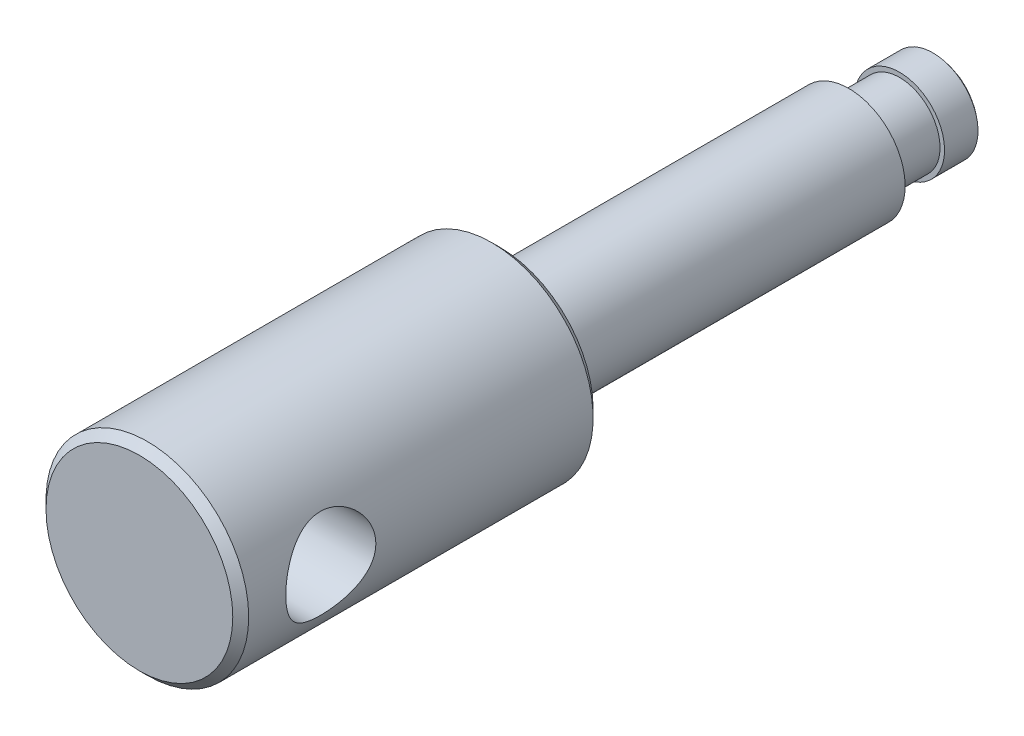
ISO-10303-21;
HEADER;
FILE_DESCRIPTION(('STEP AP214'),'2;1');
FILE_NAME('part.step','',(''),(''),'','','');
FILE_SCHEMA(('AUTOMOTIVE_DESIGN { 1 0 10303 214 1 1 1 1 }'));
ENDSEC;
DATA;
#1=APPLICATION_CONTEXT('core data for automotive mechanical design processes');
#2=APPLICATION_PROTOCOL_DEFINITION('international standard','automotive_design',2000,#1);
#3=PRODUCT_CONTEXT('',#1,'mechanical');
#4=PRODUCT('Part','Part','',(#3));
#5=PRODUCT_RELATED_PRODUCT_CATEGORY('part','',(#4));
#6=PRODUCT_DEFINITION_FORMATION('','',#4);
#7=PRODUCT_DEFINITION_CONTEXT('part definition',#1,'design');
#8=PRODUCT_DEFINITION('design','',#6,#7);
#9=PRODUCT_DEFINITION_SHAPE('','',#8);
#10=(LENGTH_UNIT() NAMED_UNIT(*) SI_UNIT(.MILLI.,.METRE.));
#11=(NAMED_UNIT(*) PLANE_ANGLE_UNIT() SI_UNIT($,.RADIAN.));
#12=(NAMED_UNIT(*) SI_UNIT($,.STERADIAN.) SOLID_ANGLE_UNIT());
#13=UNCERTAINTY_MEASURE_WITH_UNIT(LENGTH_MEASURE(1.E-05),#10,'distance_accuracy_value','');
#14=(GEOMETRIC_REPRESENTATION_CONTEXT(3) GLOBAL_UNCERTAINTY_ASSIGNED_CONTEXT((#13)) GLOBAL_UNIT_ASSIGNED_CONTEXT((#10,
#11,#12)) REPRESENTATION_CONTEXT('',''));
#15=CARTESIAN_POINT('',(0.,0.,0.));
#16=DIRECTION('',(0.,0.,1.));
#17=DIRECTION('',(1.,0.,0.));
#18=AXIS2_PLACEMENT_3D('',#15,#16,#17);
#19=CARTESIAN_POINT('',(0.,0.,6.));
#20=DIRECTION('',(-1.,0.,0.));
#21=DIRECTION('',(0.,1.,0.));
#22=AXIS2_PLACEMENT_3D('',#19,#20,#21);
#23=SPHERICAL_SURFACE('',#22,6.);
#24=CARTESIAN_POINT('',(0.,0.,1.52786404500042));
#25=DIRECTION('',(0.,0.,1.));
#26=DIRECTION('',(0.,-1.,0.));
#27=AXIS2_PLACEMENT_3D('',#24,#25,#26);
#28=CIRCLE('',#27,4.);
#29=CARTESIAN_POINT('',(0.,-4.,1.52786404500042));
#30=VERTEX_POINT('',#29);
#31=EDGE_CURVE('E112',#30,#30,#28,.T.);
#32=ORIENTED_EDGE('',*,*,#31,.F.);
#33=EDGE_LOOP('',(#32));
#34=FACE_BOUND('',#33,.T.);
#35=ADVANCED_FACE('F12',(#34),#23,.T.);
#36=CARTESIAN_POINT('',(0.,0.,0.));
#37=DIRECTION('',(0.,0.,1.));
#38=DIRECTION('',(0.,-1.,0.));
#39=AXIS2_PLACEMENT_3D('',#36,#37,#38);
#40=CYLINDRICAL_SURFACE('',#39,4.);
#41=CARTESIAN_POINT('',(0.,0.,4.5));
#42=DIRECTION('',(0.,0.,1.));
#43=DIRECTION('',(0.,-1.,0.));
#44=AXIS2_PLACEMENT_3D('',#41,#42,#43);
#45=CIRCLE('',#44,4.);
#46=CARTESIAN_POINT('',(0.,-4.,4.5));
#47=VERTEX_POINT('',#46);
#48=EDGE_CURVE('E113',#47,#47,#45,.F.);
#49=ORIENTED_EDGE('',*,*,#48,.T.);
#50=EDGE_LOOP('',(#49));
#51=FACE_BOUND('',#50,.T.);
#52=ORIENTED_EDGE('',*,*,#31,.T.);
#53=EDGE_LOOP('',(#52));
#54=FACE_BOUND('',#53,.T.);
#55=ADVANCED_FACE('F75',(#51,#54),#40,.T.);
#56=CARTESIAN_POINT('',(3.6,0.,4.5));
#57=DIRECTION('',(0.,0.,-1.));
#58=DIRECTION('',(0.,1.,0.));
#59=AXIS2_PLACEMENT_3D('',#56,#57,#58);
#60=PLANE('',#59);
#61=CARTESIAN_POINT('',(0.,0.,4.5));
#62=DIRECTION('',(0.,0.,1.));
#63=DIRECTION('',(0.,-1.,0.));
#64=AXIS2_PLACEMENT_3D('',#61,#62,#63);
#65=CIRCLE('',#64,3.6);
#66=CARTESIAN_POINT('',(0.,-3.6,4.5));
#67=VERTEX_POINT('',#66);
#68=EDGE_CURVE('E94',#67,#67,#65,.T.);
#69=ORIENTED_EDGE('',*,*,#68,.F.);
#70=EDGE_LOOP('',(#69));
#71=FACE_BOUND('',#70,.T.);
#72=ORIENTED_EDGE('',*,*,#48,.F.);
#73=EDGE_LOOP('',(#72));
#74=FACE_BOUND('',#73,.T.);
#75=ADVANCED_FACE('F71',(#71,#74),#60,.F.);
#76=CARTESIAN_POINT('',(0.,0.,0.));
#77=DIRECTION('',(0.,0.,1.));
#78=DIRECTION('',(0.,-1.,0.));
#79=AXIS2_PLACEMENT_3D('',#76,#77,#78);
#80=CYLINDRICAL_SURFACE('',#79,3.6);
#81=CARTESIAN_POINT('',(0.,0.,8.19170962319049));
#82=DIRECTION('',(0.,0.,1.));
#83=DIRECTION('',(0.,-1.,0.));
#84=AXIS2_PLACEMENT_3D('',#81,#82,#83);
#85=CIRCLE('',#84,3.60000000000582);
#86=CARTESIAN_POINT('',(0.,-3.60000000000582,8.19170962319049));
#87=VERTEX_POINT('',#86);
#88=EDGE_CURVE('E90',#87,#87,#85,.T.);
#89=ORIENTED_EDGE('',*,*,#88,.F.);
#90=EDGE_LOOP('',(#89));
#91=FACE_BOUND('',#90,.T.);
#92=ORIENTED_EDGE('',*,*,#68,.T.);
#93=EDGE_LOOP('',(#92));
#94=FACE_BOUND('',#93,.T.);
#95=ADVANCED_FACE('F67',(#91,#94),#80,.T.);
#96=CARTESIAN_POINT('',(0.,0.,9.00000000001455));
#97=DIRECTION('',(0.,0.,1.));
#98=DIRECTION('',(0.,-1.,0.));
#99=AXIS2_PLACEMENT_3D('',#96,#97,#98);
#100=CONICAL_SURFACE('',#99,4.99999999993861,1.047197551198);
#101=CARTESIAN_POINT('',(0.,0.,9.));
#102=DIRECTION('',(0.,0.,1.));
#103=DIRECTION('',(0.,-1.,0.));
#104=AXIS2_PLACEMENT_3D('',#101,#102,#103);
#105=CIRCLE('',#104,5.);
#106=CARTESIAN_POINT('',(0.,-5.,9.));
#107=VERTEX_POINT('',#106);
#108=EDGE_CURVE('E97',#107,#107,#105,.T.);
#109=ORIENTED_EDGE('',*,*,#108,.F.);
#110=EDGE_LOOP('',(#109));
#111=FACE_BOUND('',#110,.T.);
#112=ORIENTED_EDGE('',*,*,#88,.T.);
#113=EDGE_LOOP('',(#112));
#114=FACE_BOUND('',#113,.T.);
#115=ADVANCED_FACE('F63',(#111,#114),#100,.T.);
#116=CARTESIAN_POINT('',(0.,0.,0.));
#117=DIRECTION('',(0.,0.,1.));
#118=DIRECTION('',(0.,-1.,0.));
#119=AXIS2_PLACEMENT_3D('',#116,#117,#118);
#120=CYLINDRICAL_SURFACE('',#119,5.);
#121=CARTESIAN_POINT('',(0.,0.,40.));
#122=DIRECTION('',(0.,0.,1.));
#123=DIRECTION('',(0.,-1.,0.));
#124=AXIS2_PLACEMENT_3D('',#121,#122,#123);
#125=CIRCLE('',#124,5.);
#126=CARTESIAN_POINT('',(0.,-5.,40.));
#127=VERTEX_POINT('',#126);
#128=EDGE_CURVE('E93',#127,#127,#125,.F.);
#129=ORIENTED_EDGE('',*,*,#128,.T.);
#130=EDGE_LOOP('',(#129));
#131=FACE_BOUND('',#130,.T.);
#132=ORIENTED_EDGE('',*,*,#108,.T.);
#133=EDGE_LOOP('',(#132));
#134=FACE_BOUND('',#133,.T.);
#135=ADVANCED_FACE('F59',(#131,#134),#120,.T.);
#136=CARTESIAN_POINT('',(8.29289321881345,0.,40.));
#137=DIRECTION('',(0.,0.,1.));
#138=DIRECTION('',(0.,-1.,0.));
#139=AXIS2_PLACEMENT_3D('',#136,#137,#138);
#140=PLANE('',#139);
#141=CARTESIAN_POINT('',(0.,0.,40.));
#142=DIRECTION('',(0.,0.,1.));
#143=DIRECTION('',(0.,-1.,0.));
#144=AXIS2_PLACEMENT_3D('',#141,#142,#143);
#145=CIRCLE('',#144,8.29289321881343);
#146=CARTESIAN_POINT('',(0.,-8.29289321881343,40.));
#147=VERTEX_POINT('',#146);
#148=EDGE_CURVE('E100',#147,#147,#145,.T.);
#149=ORIENTED_EDGE('',*,*,#148,.F.);
#150=EDGE_LOOP('',(#149));
#151=FACE_BOUND('',#150,.T.);
#152=ORIENTED_EDGE('',*,*,#128,.F.);
#153=EDGE_LOOP('',(#152));
#154=FACE_BOUND('',#153,.T.);
#155=ADVANCED_FACE('F55',(#151,#154),#140,.F.);
#156=CARTESIAN_POINT('',(0.,0.,72.));
#157=DIRECTION('',(0.,0.,-1.));
#158=DIRECTION('',(0.,1.,0.));
#159=AXIS2_PLACEMENT_3D('',#156,#157,#158);
#160=PLANE('',#159);
#161=CARTESIAN_POINT('',(0.,0.,72.));
#162=DIRECTION('',(0.,0.,-1.));
#163=DIRECTION('',(1.,0.,0.));
#164=AXIS2_PLACEMENT_3D('',#161,#162,#163);
#165=CIRCLE('',#164,8.29289321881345);
#166=CARTESIAN_POINT('',(8.29289321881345,0.,72.));
#167=VERTEX_POINT('',#166);
#168=EDGE_CURVE('E86',#167,#167,#165,.T.);
#169=ORIENTED_EDGE('',*,*,#168,.F.);
#170=EDGE_LOOP('',(#169));
#171=FACE_BOUND('',#170,.T.);
#172=ADVANCED_FACE('F51',(#171),#160,.F.);
#173=CARTESIAN_POINT('',(0.,0.,40.7071067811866));
#174=DIRECTION('',(0.,0.,1.));
#175=DIRECTION('',(0.,-1.,0.));
#176=AXIS2_PLACEMENT_3D('',#173,#174,#175);
#177=CONICAL_SURFACE('',#176,9.,0.785398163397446);
#178=CARTESIAN_POINT('',(0.,0.,40.7071067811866));
#179=DIRECTION('',(0.,0.,1.));
#180=DIRECTION('',(0.,-1.,0.));
#181=AXIS2_PLACEMENT_3D('',#178,#179,#180);
#182=CIRCLE('',#181,9.);
#183=CARTESIAN_POINT('',(0.,-9.,40.7071067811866));
#184=VERTEX_POINT('',#183);
#185=EDGE_CURVE('E27',#184,#184,#182,.T.);
#186=ORIENTED_EDGE('',*,*,#185,.F.);
#187=EDGE_LOOP('',(#186));
#188=FACE_BOUND('',#187,.T.);
#189=ORIENTED_EDGE('',*,*,#148,.T.);
#190=EDGE_LOOP('',(#189));
#191=FACE_BOUND('',#190,.T.);
#192=ADVANCED_FACE('F47',(#188,#191),#177,.T.);
#193=CARTESIAN_POINT('',(0.,0.,71.2928932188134));
#194=DIRECTION('',(0.,0.,-1.));
#195=DIRECTION('',(1.,0.,0.));
#196=AXIS2_PLACEMENT_3D('',#193,#194,#195);
#197=CONICAL_SURFACE('',#196,9.,0.785398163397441);
#198=ORIENTED_EDGE('',*,*,#168,.T.);
#199=EDGE_LOOP('',(#198));
#200=FACE_BOUND('',#199,.T.);
#201=CARTESIAN_POINT('',(0.,0.,71.2928932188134));
#202=DIRECTION('',(0.,0.,1.));
#203=DIRECTION('',(0.,-1.,0.));
#204=AXIS2_PLACEMENT_3D('',#201,#202,#203);
#205=CIRCLE('',#204,9.);
#206=CARTESIAN_POINT('',(0.,-9.,71.2928932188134));
#207=VERTEX_POINT('',#206);
#208=EDGE_CURVE('E31',#207,#207,#205,.F.);
#209=ORIENTED_EDGE('',*,*,#208,.F.);
#210=EDGE_LOOP('',(#209));
#211=FACE_BOUND('',#210,.T.);
#212=ADVANCED_FACE('F42',(#200,#211),#197,.T.);
#213=CARTESIAN_POINT('',(0.,0.,0.));
#214=DIRECTION('',(0.,0.,1.));
#215=DIRECTION('',(0.,-1.,0.));
#216=AXIS2_PLACEMENT_3D('',#213,#214,#215);
#217=CYLINDRICAL_SURFACE('',#216,9.);
#218=CARTESIAN_POINT('',(-8.06225774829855,4.,64.));
#219=CARTESIAN_POINT('',(-8.06225871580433,3.99999911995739,63.8940426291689));
#220=CARTESIAN_POINT('',(-8.06435392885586,3.99578365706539,63.7880560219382));
#221=CARTESIAN_POINT('',(-8.07266315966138,3.9789689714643,63.5768687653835));
#222=CARTESIAN_POINT('',(-8.07887962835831,3.96636475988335,63.4716686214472));
#223=CARTESIAN_POINT('',(-8.09523141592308,3.93288406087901,63.2626821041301));
#224=CARTESIAN_POINT('',(-8.10537442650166,3.91199133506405,63.1588989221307));
#225=CARTESIAN_POINT('',(-8.12922894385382,3.8621744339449,62.9536831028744));
#226=CARTESIAN_POINT('',(-8.1429419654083,3.83324684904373,62.8522514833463));
#227=CARTESIAN_POINT('',(-8.18864631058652,3.73514516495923,62.5534876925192));
#228=CARTESIAN_POINT('',(-8.2253027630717,3.6544602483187,62.3605118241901));
#229=CARTESIAN_POINT('',(-8.30683459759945,3.46512080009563,61.9909863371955));
#230=CARTESIAN_POINT('',(-8.35170881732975,3.35647022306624,61.8144344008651));
#231=CARTESIAN_POINT('',(-8.44818605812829,3.1060059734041,61.469998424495));
#232=CARTESIAN_POINT('',(-8.50003637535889,2.96250577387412,61.3034071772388));
#233=CARTESIAN_POINT('',(-8.60260345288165,2.64995455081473,60.9956903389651));
#234=CARTESIAN_POINT('',(-8.65331973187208,2.48089290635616,60.8545753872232));
#235=CARTESIAN_POINT('',(-8.75098098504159,2.11153557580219,60.5948734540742));
#236=CARTESIAN_POINT('',(-8.79760568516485,1.9100929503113,60.477786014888));
#237=CARTESIAN_POINT('',(-8.87874924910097,1.48791769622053,60.2797334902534));
#238=CARTESIAN_POINT('',(-8.91327418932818,1.26719481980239,60.1987502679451));
#239=CARTESIAN_POINT('',(-8.96456719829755,0.82635824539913,60.0800307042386));
#240=CARTESIAN_POINT('',(-8.98225241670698,0.606957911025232,60.0400501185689));
#241=CARTESIAN_POINT('',(-9.00123386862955,0.163899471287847,59.9971753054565));
#242=CARTESIAN_POINT('',(-9.00253773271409,-0.0597566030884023,59.9942638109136));
#243=CARTESIAN_POINT('',(-8.9891172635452,-0.488489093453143,60.0245297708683));
#244=CARTESIAN_POINT('',(-8.97549378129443,-0.693781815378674,60.0552284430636));
#245=CARTESIAN_POINT('',(-8.93530946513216,-1.09594639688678,60.1475366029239));
#246=CARTESIAN_POINT('',(-8.90874767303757,-1.29281763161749,60.2091483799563));
#247=CARTESIAN_POINT('',(-8.84470124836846,-1.67619924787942,60.3621943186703));
#248=CARTESIAN_POINT('',(-8.80705628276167,-1.86250594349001,60.4540687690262));
#249=CARTESIAN_POINT('',(-8.72443358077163,-2.21755082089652,60.6645696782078));
#250=CARTESIAN_POINT('',(-8.67945317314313,-2.38628256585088,60.7832058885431));
#251=CARTESIAN_POINT('',(-8.58241773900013,-2.7154801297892,61.054628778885));
#252=CARTESIAN_POINT('',(-8.53008453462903,-2.8742540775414,61.209366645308));
#253=CARTESIAN_POINT('',(-8.42674548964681,-3.16444740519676,61.5433403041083));
#254=CARTESIAN_POINT('',(-8.37574032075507,-3.29585316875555,61.7225882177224));
#255=CARTESIAN_POINT('',(-8.30349353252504,-3.4722141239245,62.0107379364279));
#256=CARTESIAN_POINT('',(-8.27968910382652,-3.52844732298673,62.1122551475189));
#257=CARTESIAN_POINT('',(-8.23475847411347,-3.63207089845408,62.3202557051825));
#258=CARTESIAN_POINT('',(-8.2136310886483,-3.67946519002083,62.4267368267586));
#259=CARTESIAN_POINT('',(-8.17480574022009,-3.76493796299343,62.6439523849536));
#260=CARTESIAN_POINT('',(-8.15710705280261,-3.80301841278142,62.754685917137));
#261=CARTESIAN_POINT('',(-8.12581877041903,-3.86942100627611,62.9795529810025));
#262=CARTESIAN_POINT('',(-8.11222690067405,-3.89774855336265,63.0936845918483));
#263=CARTESIAN_POINT('',(-8.09048889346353,-3.94265987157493,63.3163267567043));
#264=CARTESIAN_POINT('',(-8.08202710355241,-3.95992921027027,63.4246684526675));
#265=CARTESIAN_POINT('',(-8.06944257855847,-3.98551143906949,63.6426081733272));
#266=CARTESIAN_POINT('',(-8.06531779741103,-3.99382855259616,63.7522055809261));
#267=CARTESIAN_POINT('',(-8.06156002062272,-4.00140826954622,63.9717723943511));
#268=CARTESIAN_POINT('',(-8.06192629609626,-4.00067234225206,64.0817417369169));
#269=CARTESIAN_POINT('',(-8.06713428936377,-3.99016019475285,64.3011360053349));
#270=CARTESIAN_POINT('',(-8.07197583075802,-3.9803843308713,64.4105609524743));
#271=CARTESIAN_POINT('',(-8.08540695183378,-3.95302498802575,64.6195308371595));
#272=CARTESIAN_POINT('',(-8.09367676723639,-3.93610575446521,64.7191839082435));
#273=CARTESIAN_POINT('',(-8.11360050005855,-3.89486887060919,64.9166144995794));
#274=CARTESIAN_POINT('',(-8.12525556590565,-3.87054870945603,65.0143913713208));
#275=CARTESIAN_POINT('',(-8.16479240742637,-3.78682316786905,65.3039409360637));
#276=CARTESIAN_POINT('',(-8.19725658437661,-3.71663214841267,65.4920869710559));
#277=CARTESIAN_POINT('',(-8.27248834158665,-3.54611617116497,65.8623985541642));
#278=CARTESIAN_POINT('',(-8.31565196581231,-3.44458335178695,66.043919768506));
#279=CARTESIAN_POINT('',(-8.40692978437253,-3.21539109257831,66.3883189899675));
#280=CARTESIAN_POINT('',(-8.45504630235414,-3.08771936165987,66.5511881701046));
#281=CARTESIAN_POINT('',(-8.55631670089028,-2.79562298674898,66.8697587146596));
#282=CARTESIAN_POINT('',(-8.6095148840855,-2.62885906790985,67.0233092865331));
#283=CARTESIAN_POINT('',(-8.71080374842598,-2.27079015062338,67.3007272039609));
#284=CARTESIAN_POINT('',(-8.75889370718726,-2.07948168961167,67.4245903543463));
#285=CARTESIAN_POINT('',(-8.84519710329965,-1.67498083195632,67.6396869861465));
#286=CARTESIAN_POINT('',(-8.88332261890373,-1.46161537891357,67.730632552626));
#287=CARTESIAN_POINT('',(-8.94472578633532,-1.02045840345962,67.8745834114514));
#288=CARTESIAN_POINT('',(-8.96801362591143,-0.792676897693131,67.9276147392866));
#289=CARTESIAN_POINT('',(-8.99580137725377,-0.348228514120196,67.9906336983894));
#290=CARTESIAN_POINT('',(-9.00161841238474,-0.132069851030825,68.00364083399));
#291=CARTESIAN_POINT('',(-8.99760436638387,0.299340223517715,67.9946102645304));
#292=CARTESIAN_POINT('',(-8.98777674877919,0.514591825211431,67.9725803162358));
#293=CARTESIAN_POINT('',(-8.954312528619,0.928153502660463,67.8962552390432));
#294=CARTESIAN_POINT('',(-8.93130800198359,1.12679150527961,67.8434351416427));
#295=CARTESIAN_POINT('',(-8.87418367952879,1.51223596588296,67.7087522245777));
#296=CARTESIAN_POINT('',(-8.84006193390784,1.69904034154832,67.6268843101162));
#297=CARTESIAN_POINT('',(-8.76198674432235,2.06499399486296,67.4323035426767));
#298=CARTESIAN_POINT('',(-8.71765436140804,2.24339999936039,67.3183489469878));
#299=CARTESIAN_POINT('',(-8.62423537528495,2.57934407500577,67.0645296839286));
#300=CARTESIAN_POINT('',(-8.5751467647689,2.73687326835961,66.9246540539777));
#301=CARTESIAN_POINT('',(-8.47281938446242,3.03954409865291,66.6100798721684));
#302=CARTESIAN_POINT('',(-8.41955831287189,3.18273227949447,66.4335061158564));
#303=CARTESIAN_POINT('',(-8.31863267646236,3.43791440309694,66.057266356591));
#304=CARTESIAN_POINT('',(-8.27097161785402,3.5498888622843,65.8575860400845));
#305=CARTESIAN_POINT('',(-8.20816019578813,3.69171847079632,65.5441803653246));
#306=CARTESIAN_POINT('',(-8.18863116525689,3.73471557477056,65.4371069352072));
#307=CARTESIAN_POINT('',(-8.15320381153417,3.81143772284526,65.219125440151));
#308=CARTESIAN_POINT('',(-8.13730367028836,3.84516741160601,65.1082193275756));
#309=CARTESIAN_POINT('',(-8.10978099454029,3.90288007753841,64.8837044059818));
#310=CARTESIAN_POINT('',(-8.09814723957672,3.92688863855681,64.7701035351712));
#311=CARTESIAN_POINT('',(-8.07957808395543,3.96495546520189,64.5409253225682));
#312=CARTESIAN_POINT('',(-8.07263915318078,3.9790212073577,64.4253495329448));
#313=CARTESIAN_POINT('',(-8.06621715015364,3.99201145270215,64.2578957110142));
#314=CARTESIAN_POINT('',(-8.06473388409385,3.99500589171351,64.2063769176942));
#315=CARTESIAN_POINT('',(-8.06275393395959,3.999000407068,64.103241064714));
#316=CARTESIAN_POINT('',(-8.06225727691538,4.00000042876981,64.0516240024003));
#317=CARTESIAN_POINT('',(-8.06225774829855,4.,64.));
#318=B_SPLINE_CURVE_WITH_KNOTS('',3,(#218,#219,#220,#221,#222,#223,#224,#225,#226,#227,#228,
#229,#230,#231,#232,#233,#234,#235,#236,#237,#238,#239,#240,#241,#242,#243,#244,#245,#246,#247,
#248,#249,#250,#251,#252,#253,#254,#255,#256,#257,#258,#259,#260,#261,#262,#263,#264,#265,#266,
#267,#268,#269,#270,#271,#272,#273,#274,#275,#276,#277,#278,#279,#280,#281,#282,#283,#284,#285,
#286,#287,#288,#289,#290,#291,#292,#293,#294,#295,#296,#297,#298,#299,#300,#301,#302,#303,#304,
#305,#306,#307,#308,#309,#310,#311,#312,#313,#314,#315,#316,#317),.UNSPECIFIED.,.T.,.F.,(4,2,2,
2,2,2,2,2,2,2,2,2,2,2,2,2,2,2,2,2,2,2,2,2,2,2,2,2,2,2,2,2,2,2,2,2,2,2,2,2,2,2,2,2,2,2,2,2,2,4),
(0.,0.317818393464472,0.635825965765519,0.954459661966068,1.27322877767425,1.9072287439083,
2.54113910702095,3.21592082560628,3.89098369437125,4.60017396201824,5.30900756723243,
5.97655382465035,6.64378912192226,7.2649383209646,7.88613352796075,8.51679809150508,
9.1476928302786,9.82817138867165,10.5089876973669,10.8640051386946,11.2188649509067,
11.573649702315,11.9282375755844,12.2578989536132,12.5874047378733,12.9168570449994,
13.2462963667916,13.5501886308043,13.8541841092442,14.4617122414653,15.0964254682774,
15.7314378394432,16.4267756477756,17.1222116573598,17.8235911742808,18.5244885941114,
19.1710234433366,19.8174151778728,20.435125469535,21.0529441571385,21.6990794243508,
22.3454885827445,23.0428199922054,23.7405857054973,24.0912600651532,24.4417583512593,
24.7913281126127,25.1406347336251,25.2954763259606,25.4503221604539),.UNSPECIFIED.);
#319=CARTESIAN_POINT('',(-8.06225774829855,4.,64.));
#320=VERTEX_POINT('',#319);
#321=EDGE_CURVE('E23',#320,#320,#318,.T.);
#322=ORIENTED_EDGE('',*,*,#321,.F.);
#323=EDGE_LOOP('',(#322));
#324=FACE_BOUND('',#323,.T.);
#325=ORIENTED_EDGE('',*,*,#208,.T.);
#326=EDGE_LOOP('',(#325));
#327=FACE_BOUND('',#326,.T.);
#328=CARTESIAN_POINT('',(8.06225774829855,4.,64.));
#329=CARTESIAN_POINT('',(8.06225871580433,3.99999911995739,64.1059573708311));
#330=CARTESIAN_POINT('',(8.06435392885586,3.99578365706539,64.2119439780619));
#331=CARTESIAN_POINT('',(8.07266315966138,3.9789689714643,64.4231312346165));
#332=CARTESIAN_POINT('',(8.07887962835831,3.96636475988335,64.5283313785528));
#333=CARTESIAN_POINT('',(8.09523141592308,3.93288406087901,64.7373178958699));
#334=CARTESIAN_POINT('',(8.10537442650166,3.91199133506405,64.8411010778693));
#335=CARTESIAN_POINT('',(8.12922894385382,3.8621744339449,65.0463168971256));
#336=CARTESIAN_POINT('',(8.1429419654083,3.83324684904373,65.1477485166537));
#337=CARTESIAN_POINT('',(8.18864631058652,3.73514516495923,65.4465123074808));
#338=CARTESIAN_POINT('',(8.2253027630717,3.65446024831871,65.6394881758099));
#339=CARTESIAN_POINT('',(8.30683459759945,3.46512080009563,66.0090136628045));
#340=CARTESIAN_POINT('',(8.35170881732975,3.35647022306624,66.1855655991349));
#341=CARTESIAN_POINT('',(8.44818605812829,3.1060059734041,66.530001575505));
#342=CARTESIAN_POINT('',(8.50003637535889,2.96250577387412,66.6965928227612));
#343=CARTESIAN_POINT('',(8.60260345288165,2.64995455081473,67.0043096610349));
#344=CARTESIAN_POINT('',(8.65331973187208,2.48089290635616,67.1454246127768));
#345=CARTESIAN_POINT('',(8.75098098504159,2.11153557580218,67.4051265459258));
#346=CARTESIAN_POINT('',(8.79760568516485,1.9100929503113,67.522213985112));
#347=CARTESIAN_POINT('',(8.87874924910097,1.48791769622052,67.7202665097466));
#348=CARTESIAN_POINT('',(8.91327418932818,1.26719481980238,67.8012497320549));
#349=CARTESIAN_POINT('',(8.96456719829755,0.826358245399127,67.9199692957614));
#350=CARTESIAN_POINT('',(8.98225241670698,0.606957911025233,67.9599498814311));
#351=CARTESIAN_POINT('',(9.00123386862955,0.16389947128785,68.0028246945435));
#352=CARTESIAN_POINT('',(9.00253773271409,-0.0597566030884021,68.0057361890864));
#353=CARTESIAN_POINT('',(8.9891172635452,-0.488489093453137,67.9754702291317));
#354=CARTESIAN_POINT('',(8.97549378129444,-0.69378181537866,67.9447715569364));
#355=CARTESIAN_POINT('',(8.93530946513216,-1.09594639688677,67.8524633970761));
#356=CARTESIAN_POINT('',(8.90874767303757,-1.2928176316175,67.7908516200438));
#357=CARTESIAN_POINT('',(8.84470124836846,-1.67619924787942,67.6378056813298));
#358=CARTESIAN_POINT('',(8.80705628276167,-1.86250594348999,67.5459312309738));
#359=CARTESIAN_POINT('',(8.72443358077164,-2.2175508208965,67.3354303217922));
#360=CARTESIAN_POINT('',(8.67945317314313,-2.38628256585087,67.2167941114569));
#361=CARTESIAN_POINT('',(8.58241773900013,-2.71548012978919,66.945371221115));
#362=CARTESIAN_POINT('',(8.53008453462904,-2.87425407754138,66.790633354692));
#363=CARTESIAN_POINT('',(8.42674548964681,-3.16444740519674,66.4566596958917));
#364=CARTESIAN_POINT('',(8.37574032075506,-3.29585316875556,66.2774117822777));
#365=CARTESIAN_POINT('',(8.30349353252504,-3.47221412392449,65.9892620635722));
#366=CARTESIAN_POINT('',(8.27968910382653,-3.52844732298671,65.8877448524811));
#367=CARTESIAN_POINT('',(8.23475847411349,-3.63207089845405,65.6797442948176));
#368=CARTESIAN_POINT('',(8.21363108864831,-3.67946519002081,65.5732631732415));
#369=CARTESIAN_POINT('',(8.1748057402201,-3.76493796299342,65.3560476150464));
#370=CARTESIAN_POINT('',(8.15710705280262,-3.80301841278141,65.245314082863));
#371=CARTESIAN_POINT('',(8.12581877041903,-3.86942100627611,65.0204470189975));
#372=CARTESIAN_POINT('',(8.11222690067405,-3.89774855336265,64.9063154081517));
#373=CARTESIAN_POINT('',(8.09048889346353,-3.94265987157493,64.6836732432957));
#374=CARTESIAN_POINT('',(8.08202710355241,-3.95992921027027,64.5753315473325));
#375=CARTESIAN_POINT('',(8.06944257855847,-3.98551143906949,64.3573918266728));
#376=CARTESIAN_POINT('',(8.06531779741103,-3.99382855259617,64.2477944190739));
#377=CARTESIAN_POINT('',(8.06156002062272,-4.00140826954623,64.0282276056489));
#378=CARTESIAN_POINT('',(8.06192629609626,-4.00067234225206,63.9182582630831));
#379=CARTESIAN_POINT('',(8.06713428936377,-3.99016019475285,63.6988639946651));
#380=CARTESIAN_POINT('',(8.07197583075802,-3.9803843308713,63.5894390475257));
#381=CARTESIAN_POINT('',(8.08540695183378,-3.95302498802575,63.3804691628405));
#382=CARTESIAN_POINT('',(8.09367676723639,-3.93610575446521,63.2808160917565));
#383=CARTESIAN_POINT('',(8.11360050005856,-3.89486887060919,63.0833855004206));
#384=CARTESIAN_POINT('',(8.12525556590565,-3.87054870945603,62.9856086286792));
#385=CARTESIAN_POINT('',(8.16479240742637,-3.78682316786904,62.6960590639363));
#386=CARTESIAN_POINT('',(8.19725658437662,-3.71663214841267,62.5079130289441));
#387=CARTESIAN_POINT('',(8.27248834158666,-3.54611617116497,62.1376014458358));
#388=CARTESIAN_POINT('',(8.31565196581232,-3.44458335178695,61.9560802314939));
#389=CARTESIAN_POINT('',(8.40692978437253,-3.21539109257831,61.6116810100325));
#390=CARTESIAN_POINT('',(8.45504630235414,-3.08771936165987,61.4488118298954));
#391=CARTESIAN_POINT('',(8.55631670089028,-2.79562298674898,61.1302412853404));
#392=CARTESIAN_POINT('',(8.6095148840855,-2.62885906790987,60.9766907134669));
#393=CARTESIAN_POINT('',(8.71080374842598,-2.2707901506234,60.6992727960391));
#394=CARTESIAN_POINT('',(8.75889370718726,-2.07948168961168,60.5754096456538));
#395=CARTESIAN_POINT('',(8.84519710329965,-1.67498083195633,60.3603130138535));
#396=CARTESIAN_POINT('',(8.88332261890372,-1.4616153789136,60.269367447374));
#397=CARTESIAN_POINT('',(8.94472578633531,-1.02045840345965,60.1254165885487));
#398=CARTESIAN_POINT('',(8.96801362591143,-0.792676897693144,60.0723852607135));
#399=CARTESIAN_POINT('',(8.99580137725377,-0.348228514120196,60.0093663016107));
#400=CARTESIAN_POINT('',(9.00161841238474,-0.13206985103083,59.99635916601));
#401=CARTESIAN_POINT('',(8.99760436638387,0.299340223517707,60.0053897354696));
#402=CARTESIAN_POINT('',(8.98777674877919,0.514591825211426,60.0274196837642));
#403=CARTESIAN_POINT('',(8.954312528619,0.92815350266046,60.1037447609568));
#404=CARTESIAN_POINT('',(8.93130800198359,1.12679150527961,60.1565648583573));
#405=CARTESIAN_POINT('',(8.87418367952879,1.51223596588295,60.2912477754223));
#406=CARTESIAN_POINT('',(8.84006193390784,1.69904034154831,60.3731156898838));
#407=CARTESIAN_POINT('',(8.76198674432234,2.06499399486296,60.5676964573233));
#408=CARTESIAN_POINT('',(8.71765436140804,2.24339999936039,60.6816510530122));
#409=CARTESIAN_POINT('',(8.62423537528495,2.57934407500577,60.9354703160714));
#410=CARTESIAN_POINT('',(8.5751467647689,2.73687326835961,61.0753459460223));
#411=CARTESIAN_POINT('',(8.47281938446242,3.03954409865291,61.3899201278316));
#412=CARTESIAN_POINT('',(8.41955831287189,3.18273227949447,61.5664938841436));
#413=CARTESIAN_POINT('',(8.31863267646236,3.43791440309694,61.942733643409));
#414=CARTESIAN_POINT('',(8.27097161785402,3.5498888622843,62.1424139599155));
#415=CARTESIAN_POINT('',(8.20816019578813,3.69171847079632,62.4558196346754));
#416=CARTESIAN_POINT('',(8.18863116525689,3.73471557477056,62.5628930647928));
#417=CARTESIAN_POINT('',(8.15320381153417,3.81143772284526,62.780874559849));
#418=CARTESIAN_POINT('',(8.13730367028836,3.84516741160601,62.8917806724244));
#419=CARTESIAN_POINT('',(8.10978099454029,3.90288007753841,63.1162955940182));
#420=CARTESIAN_POINT('',(8.09814723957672,3.9268886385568,63.2298964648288));
#421=CARTESIAN_POINT('',(8.07957808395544,3.96495546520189,63.4590746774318));
#422=CARTESIAN_POINT('',(8.07263915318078,3.9790212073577,63.5746504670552));
#423=CARTESIAN_POINT('',(8.06621715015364,3.99201145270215,63.7421042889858));
#424=CARTESIAN_POINT('',(8.06473388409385,3.99500589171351,63.7936230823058));
#425=CARTESIAN_POINT('',(8.06275393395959,3.999000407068,63.896758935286));
#426=CARTESIAN_POINT('',(8.06225727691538,4.00000042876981,63.9483759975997));
#427=CARTESIAN_POINT('',(8.06225774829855,4.,64.));
#428=B_SPLINE_CURVE_WITH_KNOTS('',3,(#328,#329,#330,#331,#332,#333,#334,#335,#336,#337,#338,
#339,#340,#341,#342,#343,#344,#345,#346,#347,#348,#349,#350,#351,#352,#353,#354,#355,#356,#357,
#358,#359,#360,#361,#362,#363,#364,#365,#366,#367,#368,#369,#370,#371,#372,#373,#374,#375,#376,
#377,#378,#379,#380,#381,#382,#383,#384,#385,#386,#387,#388,#389,#390,#391,#392,#393,#394,#395,
#396,#397,#398,#399,#400,#401,#402,#403,#404,#405,#406,#407,#408,#409,#410,#411,#412,#413,#414,
#415,#416,#417,#418,#419,#420,#421,#422,#423,#424,#425,#426,#427),.UNSPECIFIED.,.T.,.F.,(4,2,2,
2,2,2,2,2,2,2,2,2,2,2,2,2,2,2,2,2,2,2,2,2,2,2,2,2,2,2,2,2,2,2,2,2,2,2,2,2,2,2,2,2,2,2,2,2,2,4),
(0.,0.317818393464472,0.635825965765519,0.954459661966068,1.27322877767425,1.90722874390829,
2.54113910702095,3.21592082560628,3.89098369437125,4.60017396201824,5.30900756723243,
5.97655382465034,6.64378912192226,7.26493832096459,7.88613352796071,8.51679809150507,
9.14769283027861,9.82817138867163,10.5089876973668,10.8640051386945,11.2188649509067,
11.5736497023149,11.9282375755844,12.2578989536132,12.5874047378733,12.9168570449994,
13.2462963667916,13.5501886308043,13.8541841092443,14.4617122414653,15.0964254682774,
15.7314378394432,16.4267756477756,17.1222116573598,17.8235911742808,18.5244885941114,
19.1710234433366,19.8174151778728,20.435125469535,21.0529441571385,21.6990794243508,
22.3454885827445,23.0428199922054,23.7405857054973,24.0912600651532,24.4417583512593,
24.7913281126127,25.1406347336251,25.2954763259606,25.4503221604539),.UNSPECIFIED.);
#429=CARTESIAN_POINT('',(8.06225774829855,4.,64.));
#430=VERTEX_POINT('',#429);
#431=EDGE_CURVE('E8',#430,#430,#428,.T.);
#432=ORIENTED_EDGE('',*,*,#431,.F.);
#433=EDGE_LOOP('',(#432));
#434=FACE_BOUND('',#433,.T.);
#435=ORIENTED_EDGE('',*,*,#185,.T.);
#436=EDGE_LOOP('',(#435));
#437=FACE_BOUND('',#436,.T.);
#438=ADVANCED_FACE('F38',(#324,#327,#434,#437),#217,.T.);
#439=CARTESIAN_POINT('',(-17.0022539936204,0.,64.));
#440=DIRECTION('',(1.,0.,0.));
#441=DIRECTION('',(0.,1.,0.));
#442=AXIS2_PLACEMENT_3D('',#439,#440,#441);
#443=CYLINDRICAL_SURFACE('',#442,4.);
#444=ORIENTED_EDGE('',*,*,#321,.T.);
#445=EDGE_LOOP('',(#444));
#446=FACE_BOUND('',#445,.T.);
#447=ORIENTED_EDGE('',*,*,#431,.T.);
#448=EDGE_LOOP('',(#447));
#449=FACE_BOUND('',#448,.T.);
#450=ADVANCED_FACE('F14',(#446,#449),#443,.F.);
#451=CLOSED_SHELL('',(#35,#55,#75,#95,#115,#135,#155,#172,#192,#212,#438,#450));
#452=MANIFOLD_SOLID_BREP('B1',#451);
#453=ADVANCED_BREP_SHAPE_REPRESENTATION('',(#18,#452),#14);
#454=SHAPE_DEFINITION_REPRESENTATION(#9,#453);
ENDSEC;
END-ISO-10303-21;
